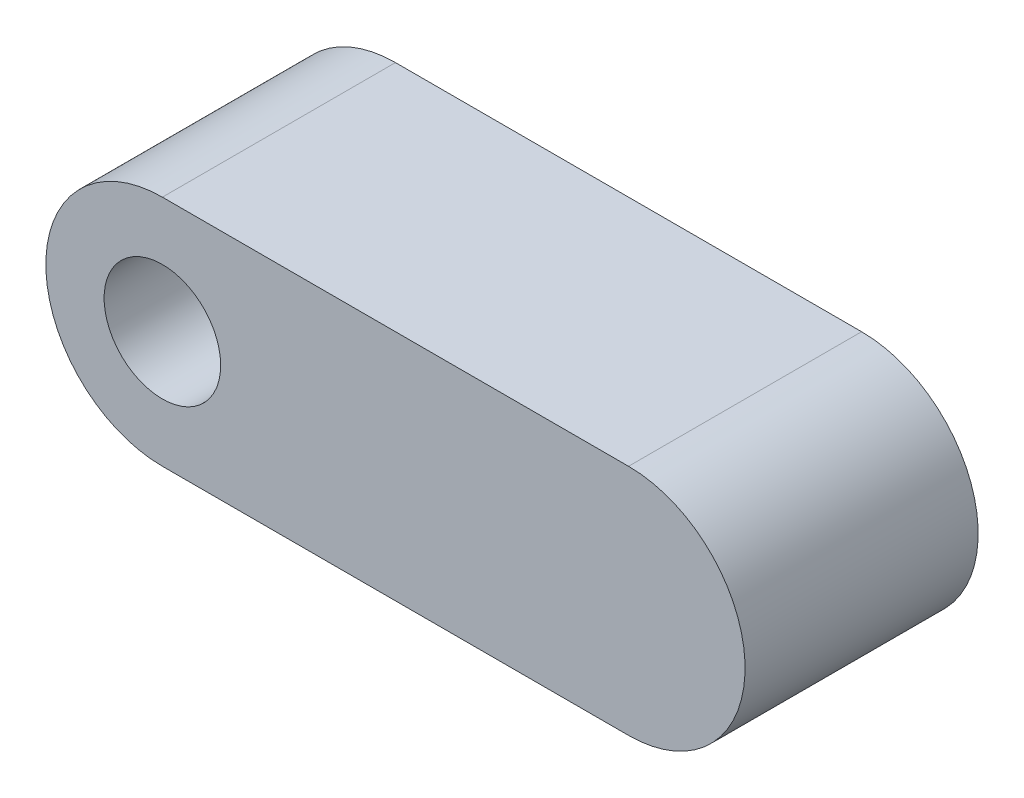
from build123d import *

# Parameters (mm, degrees)
ESQUISSE1_R      = 0.5
EXTRUSION1_DEPTH = 1


with BuildPart() as part:
    # Esquisse1 → Extrusion1 (new, symmetric)
    with BuildSketch(Plane.XY):
        with BuildLine():
            Line((0, 1), (4, 1))
            ThreePointArc((4, 1), (5, 0), (4, -1))
            Line((4, -1), (0, -1))
            ThreePointArc((0, -1), (-1, 0), (0, 1))
        make_face()
        Circle(ESQUISSE1_R, mode=Mode.SUBTRACT)
    extrude(amount=EXTRUSION1_DEPTH, both=True)


solid = part.part
